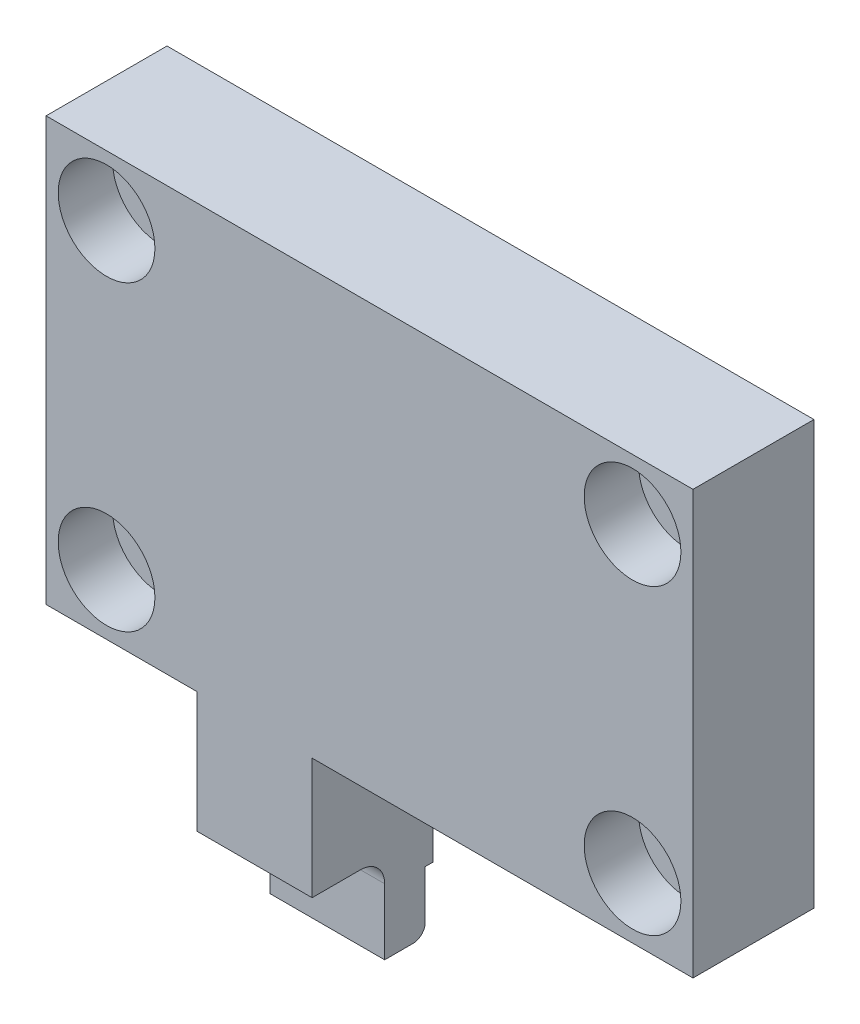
ISO-10303-21;
HEADER;
FILE_DESCRIPTION(('STEP AP214'),'2;1');
FILE_NAME('part.step','',(''),(''),'','','');
FILE_SCHEMA(('AUTOMOTIVE_DESIGN { 1 0 10303 214 1 1 1 1 }'));
ENDSEC;
DATA;
#1=APPLICATION_CONTEXT('core data for automotive mechanical design processes');
#2=APPLICATION_PROTOCOL_DEFINITION('international standard','automotive_design',2000,#1);
#3=PRODUCT_CONTEXT('',#1,'mechanical');
#4=PRODUCT('Part','Part','',(#3));
#5=PRODUCT_RELATED_PRODUCT_CATEGORY('part','',(#4));
#6=PRODUCT_DEFINITION_FORMATION('','',#4);
#7=PRODUCT_DEFINITION_CONTEXT('part definition',#1,'design');
#8=PRODUCT_DEFINITION('design','',#6,#7);
#9=PRODUCT_DEFINITION_SHAPE('','',#8);
#10=(LENGTH_UNIT() NAMED_UNIT(*) SI_UNIT(.MILLI.,.METRE.));
#11=(NAMED_UNIT(*) PLANE_ANGLE_UNIT() SI_UNIT($,.RADIAN.));
#12=(NAMED_UNIT(*) SI_UNIT($,.STERADIAN.) SOLID_ANGLE_UNIT());
#13=UNCERTAINTY_MEASURE_WITH_UNIT(LENGTH_MEASURE(1.E-05),#10,'distance_accuracy_value','');
#14=(GEOMETRIC_REPRESENTATION_CONTEXT(3) GLOBAL_UNCERTAINTY_ASSIGNED_CONTEXT((#13)) GLOBAL_UNIT_ASSIGNED_CONTEXT((#10,
#11,#12)) REPRESENTATION_CONTEXT('',''));
#15=CARTESIAN_POINT('',(0.,0.,0.));
#16=DIRECTION('',(0.,0.,1.));
#17=DIRECTION('',(1.,0.,0.));
#18=AXIS2_PLACEMENT_3D('',#15,#16,#17);
#19=CARTESIAN_POINT('',(12.5,17.4499995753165,10.));
#20=DIRECTION('',(0.,0.,1.));
#21=DIRECTION('',(1.,0.,0.));
#22=AXIS2_PLACEMENT_3D('',#19,#20,#21);
#23=PLANE('',#22);
#24=CARTESIAN_POINT('',(5.00000000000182,47.4499995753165,10.));
#25=DIRECTION('',(0.,0.,1.));
#26=DIRECTION('',(1.,0.,0.));
#27=AXIS2_PLACEMENT_3D('',#24,#25,#26);
#28=CIRCLE('',#27,4.);
#29=CARTESIAN_POINT('',(9.00000000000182,47.4499995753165,10.));
#30=VERTEX_POINT('',#29);
#31=EDGE_CURVE('E218',#30,#30,#28,.T.);
#32=ORIENTED_EDGE('',*,*,#31,.F.);
#33=EDGE_LOOP('',(#32));
#34=FACE_BOUND('',#33,.T.);
#35=CARTESIAN_POINT('',(48.5000000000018,47.4499995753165,10.));
#36=DIRECTION('',(0.,0.,1.));
#37=DIRECTION('',(1.,0.,0.));
#38=AXIS2_PLACEMENT_3D('',#35,#36,#37);
#39=CIRCLE('',#38,4.);
#40=CARTESIAN_POINT('',(52.5000000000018,47.4499995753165,10.));
#41=VERTEX_POINT('',#40);
#42=EDGE_CURVE('E223',#41,#41,#39,.T.);
#43=ORIENTED_EDGE('',*,*,#42,.F.);
#44=EDGE_LOOP('',(#43));
#45=FACE_BOUND('',#44,.T.);
#46=CARTESIAN_POINT('',(48.5000000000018,22.4499995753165,10.));
#47=DIRECTION('',(0.,0.,1.));
#48=DIRECTION('',(1.,0.,0.));
#49=AXIS2_PLACEMENT_3D('',#46,#47,#48);
#50=CIRCLE('',#49,4.);
#51=CARTESIAN_POINT('',(52.5000000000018,22.4499995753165,10.));
#52=VERTEX_POINT('',#51);
#53=EDGE_CURVE('E228',#52,#52,#50,.T.);
#54=ORIENTED_EDGE('',*,*,#53,.F.);
#55=EDGE_LOOP('',(#54));
#56=FACE_BOUND('',#55,.T.);
#57=CARTESIAN_POINT('',(5.00000000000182,22.4499995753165,10.));
#58=DIRECTION('',(0.,0.,1.));
#59=DIRECTION('',(1.,0.,0.));
#60=AXIS2_PLACEMENT_3D('',#57,#58,#59);
#61=CIRCLE('',#60,4.);
#62=CARTESIAN_POINT('',(9.00000000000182,22.4499995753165,10.));
#63=VERTEX_POINT('',#62);
#64=EDGE_CURVE('E276',#63,#63,#61,.T.);
#65=ORIENTED_EDGE('',*,*,#64,.F.);
#66=EDGE_LOOP('',(#65));
#67=FACE_BOUND('',#66,.T.);
#68=DIRECTION('',(0.,-1.,0.));
#69=VECTOR('',#68,1.);
#70=CARTESIAN_POINT('',(12.5,0.,10.));
#71=LINE('',#70,#69);
#72=CARTESIAN_POINT('',(12.5,17.4499995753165,10.));
#73=VERTEX_POINT('',#72);
#74=CARTESIAN_POINT('',(12.5,7.44999957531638,10.));
#75=VERTEX_POINT('',#74);
#76=EDGE_CURVE('E147',#73,#75,#71,.T.);
#77=ORIENTED_EDGE('',*,*,#76,.T.);
#78=DIRECTION('',(1.,0.,0.));
#79=VECTOR('',#78,1.);
#80=CARTESIAN_POINT('',(1.81799020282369E-12,7.44999957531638,10.));
#81=LINE('',#80,#79);
#82=CARTESIAN_POINT('',(22.,7.44999957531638,10.));
#83=VERTEX_POINT('',#82);
#84=EDGE_CURVE('E131',#75,#83,#81,.T.);
#85=ORIENTED_EDGE('',*,*,#84,.T.);
#86=DIRECTION('',(0.,1.,0.));
#87=VECTOR('',#86,1.);
#88=CARTESIAN_POINT('',(22.,0.,10.));
#89=LINE('',#88,#87);
#90=CARTESIAN_POINT('',(22.,17.4499995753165,10.));
#91=VERTEX_POINT('',#90);
#92=EDGE_CURVE('E156',#83,#91,#89,.T.);
#93=ORIENTED_EDGE('',*,*,#92,.T.);
#94=DIRECTION('',(1.,0.,0.));
#95=VECTOR('',#94,1.);
#96=CARTESIAN_POINT('',(22.,17.4499995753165,10.));
#97=LINE('',#96,#95);
#98=CARTESIAN_POINT('',(53.5000000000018,17.4499995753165,10.));
#99=VERTEX_POINT('',#98);
#100=EDGE_CURVE('E158',#91,#99,#97,.T.);
#101=ORIENTED_EDGE('',*,*,#100,.T.);
#102=DIRECTION('',(0.,1.,0.));
#103=VECTOR('',#102,1.);
#104=CARTESIAN_POINT('',(53.5000000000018,17.4499995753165,10.));
#105=LINE('',#104,#103);
#106=CARTESIAN_POINT('',(53.5000000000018,52.4499995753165,10.));
#107=VERTEX_POINT('',#106);
#108=EDGE_CURVE('E165',#99,#107,#105,.T.);
#109=ORIENTED_EDGE('',*,*,#108,.T.);
#110=DIRECTION('',(-1.,0.,0.));
#111=VECTOR('',#110,1.);
#112=CARTESIAN_POINT('',(1.81898940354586E-12,52.4499995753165,10.));
#113=LINE('',#112,#111);
#114=CARTESIAN_POINT('',(1.81898940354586E-12,52.4499995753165,10.));
#115=VERTEX_POINT('',#114);
#116=EDGE_CURVE('E167',#107,#115,#113,.T.);
#117=ORIENTED_EDGE('',*,*,#116,.T.);
#118=DIRECTION('',(0.,-1.,0.));
#119=VECTOR('',#118,1.);
#120=CARTESIAN_POINT('',(1.81898940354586E-12,17.4499995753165,10.));
#121=LINE('',#120,#119);
#122=CARTESIAN_POINT('',(1.81898940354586E-12,17.4499995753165,10.));
#123=VERTEX_POINT('',#122);
#124=EDGE_CURVE('E169',#115,#123,#121,.T.);
#125=ORIENTED_EDGE('',*,*,#124,.T.);
#126=DIRECTION('',(1.,0.,0.));
#127=VECTOR('',#126,1.);
#128=CARTESIAN_POINT('',(1.81898940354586E-12,17.4499995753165,10.));
#129=LINE('',#128,#127);
#130=EDGE_CURVE('E154',#123,#73,#129,.T.);
#131=ORIENTED_EDGE('',*,*,#130,.T.);
#132=EDGE_LOOP('',(#77,#85,#93,#101,#109,#117,#125,#131));
#133=FACE_BOUND('',#132,.T.);
#134=ADVANCED_FACE('F33',(#34,#45,#56,#67,#133),#23,.T.);
#135=CARTESIAN_POINT('',(12.5,17.4499995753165,0.));
#136=DIRECTION('',(0.,0.,1.));
#137=DIRECTION('',(1.,0.,0.));
#138=AXIS2_PLACEMENT_3D('',#135,#136,#137);
#139=PLANE('',#138);
#140=CARTESIAN_POINT('',(5.00000000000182,22.4499995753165,0.));
#141=DIRECTION('',(0.,0.,1.));
#142=DIRECTION('',(1.,0.,0.));
#143=AXIS2_PLACEMENT_3D('',#140,#141,#142);
#144=CIRCLE('',#143,2.25);
#145=CARTESIAN_POINT('',(7.25000000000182,22.4499995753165,0.));
#146=VERTEX_POINT('',#145);
#147=EDGE_CURVE('E213',#146,#146,#144,.T.);
#148=ORIENTED_EDGE('',*,*,#147,.T.);
#149=EDGE_LOOP('',(#148));
#150=FACE_BOUND('',#149,.T.);
#151=CARTESIAN_POINT('',(48.5000000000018,47.4499995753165,0.));
#152=DIRECTION('',(0.,0.,1.));
#153=DIRECTION('',(1.,0.,0.));
#154=AXIS2_PLACEMENT_3D('',#151,#152,#153);
#155=CIRCLE('',#154,2.25);
#156=CARTESIAN_POINT('',(50.7500000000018,47.4499995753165,0.));
#157=VERTEX_POINT('',#156);
#158=EDGE_CURVE('E298',#157,#157,#155,.T.);
#159=ORIENTED_EDGE('',*,*,#158,.T.);
#160=EDGE_LOOP('',(#159));
#161=FACE_BOUND('',#160,.T.);
#162=CARTESIAN_POINT('',(5.00000000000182,47.4499995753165,0.));
#163=DIRECTION('',(0.,0.,1.));
#164=DIRECTION('',(1.,0.,0.));
#165=AXIS2_PLACEMENT_3D('',#162,#163,#164);
#166=CIRCLE('',#165,2.25);
#167=CARTESIAN_POINT('',(7.25000000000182,47.4499995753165,0.));
#168=VERTEX_POINT('',#167);
#169=EDGE_CURVE('E176',#168,#168,#166,.T.);
#170=ORIENTED_EDGE('',*,*,#169,.T.);
#171=EDGE_LOOP('',(#170));
#172=FACE_BOUND('',#171,.T.);
#173=CARTESIAN_POINT('',(48.5000000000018,22.4499995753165,0.));
#174=DIRECTION('',(0.,0.,1.));
#175=DIRECTION('',(1.,0.,0.));
#176=AXIS2_PLACEMENT_3D('',#173,#174,#175);
#177=CIRCLE('',#176,2.25);
#178=CARTESIAN_POINT('',(50.7500000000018,22.4499995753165,0.));
#179=VERTEX_POINT('',#178);
#180=EDGE_CURVE('E295',#179,#179,#177,.T.);
#181=ORIENTED_EDGE('',*,*,#180,.T.);
#182=EDGE_LOOP('',(#181));
#183=FACE_BOUND('',#182,.T.);
#184=DIRECTION('',(1.,0.,0.));
#185=VECTOR('',#184,1.);
#186=CARTESIAN_POINT('',(1.81799020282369E-12,4.99999999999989,0.));
#187=LINE('',#186,#185);
#188=CARTESIAN_POINT('',(12.5,4.99999999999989,0.));
#189=VERTEX_POINT('',#188);
#190=CARTESIAN_POINT('',(22.,4.99999999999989,0.));
#191=VERTEX_POINT('',#190);
#192=EDGE_CURVE('E140',#189,#191,#187,.T.);
#193=ORIENTED_EDGE('',*,*,#192,.F.);
#194=DIRECTION('',(0.,-1.,0.));
#195=VECTOR('',#194,1.);
#196=CARTESIAN_POINT('',(12.5,0.,0.));
#197=LINE('',#196,#195);
#198=CARTESIAN_POINT('',(12.5,17.4499995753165,0.));
#199=VERTEX_POINT('',#198);
#200=EDGE_CURVE('E175',#199,#189,#197,.T.);
#201=ORIENTED_EDGE('',*,*,#200,.F.);
#202=DIRECTION('',(1.,0.,0.));
#203=VECTOR('',#202,1.);
#204=CARTESIAN_POINT('',(1.81898940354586E-12,17.4499995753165,0.));
#205=LINE('',#204,#203);
#206=CARTESIAN_POINT('',(1.81898940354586E-12,17.4499995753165,0.));
#207=VERTEX_POINT('',#206);
#208=EDGE_CURVE('E172',#207,#199,#205,.T.);
#209=ORIENTED_EDGE('',*,*,#208,.F.);
#210=DIRECTION('',(0.,-1.,0.));
#211=VECTOR('',#210,1.);
#212=CARTESIAN_POINT('',(1.81898940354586E-12,17.4499995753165,0.));
#213=LINE('',#212,#211);
#214=CARTESIAN_POINT('',(1.81898940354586E-12,52.4499995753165,0.));
#215=VERTEX_POINT('',#214);
#216=EDGE_CURVE('E160',#215,#207,#213,.T.);
#217=ORIENTED_EDGE('',*,*,#216,.F.);
#218=DIRECTION('',(-1.,0.,0.));
#219=VECTOR('',#218,1.);
#220=CARTESIAN_POINT('',(1.81898940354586E-12,52.4499995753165,0.));
#221=LINE('',#220,#219);
#222=CARTESIAN_POINT('',(53.5000000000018,52.4499995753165,0.));
#223=VERTEX_POINT('',#222);
#224=EDGE_CURVE('E185',#223,#215,#221,.T.);
#225=ORIENTED_EDGE('',*,*,#224,.F.);
#226=DIRECTION('',(0.,1.,0.));
#227=VECTOR('',#226,1.);
#228=CARTESIAN_POINT('',(53.5000000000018,17.4499995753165,0.));
#229=LINE('',#228,#227);
#230=CARTESIAN_POINT('',(53.5000000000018,17.4499995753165,0.));
#231=VERTEX_POINT('',#230);
#232=EDGE_CURVE('E183',#231,#223,#229,.T.);
#233=ORIENTED_EDGE('',*,*,#232,.F.);
#234=DIRECTION('',(1.,0.,0.));
#235=VECTOR('',#234,1.);
#236=CARTESIAN_POINT('',(22.,17.4499995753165,0.));
#237=LINE('',#236,#235);
#238=CARTESIAN_POINT('',(22.,17.4499995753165,0.));
#239=VERTEX_POINT('',#238);
#240=EDGE_CURVE('E181',#239,#231,#237,.T.);
#241=ORIENTED_EDGE('',*,*,#240,.F.);
#242=DIRECTION('',(0.,1.,0.));
#243=VECTOR('',#242,1.);
#244=CARTESIAN_POINT('',(22.,0.,0.));
#245=LINE('',#244,#243);
#246=EDGE_CURVE('E179',#191,#239,#245,.T.);
#247=ORIENTED_EDGE('',*,*,#246,.F.);
#248=EDGE_LOOP('',(#193,#201,#209,#217,#225,#233,#241,#247));
#249=FACE_BOUND('',#248,.T.);
#250=ADVANCED_FACE('F303',(#150,#161,#172,#183,#249),#139,.F.);
#251=CARTESIAN_POINT('',(12.5,0.,10.));
#252=DIRECTION('',(1.,0.,0.));
#253=DIRECTION('',(0.,0.,-1.));
#254=AXIS2_PLACEMENT_3D('',#251,#252,#253);
#255=PLANE('',#254);
#256=DIRECTION('',(0.,0.,-1.));
#257=VECTOR('',#256,1.);
#258=CARTESIAN_POINT('',(12.5,4.99999999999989,10.));
#259=LINE('',#258,#257);
#260=CARTESIAN_POINT('',(12.5,4.99999999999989,0.650000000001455));
#261=VERTEX_POINT('',#260);
#262=EDGE_CURVE('E274',#261,#189,#259,.T.);
#263=ORIENTED_EDGE('',*,*,#262,.F.);
#264=DIRECTION('',(0.,1.,0.));
#265=VECTOR('',#264,1.);
#266=CARTESIAN_POINT('',(12.5,0.,0.650000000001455));
#267=LINE('',#266,#265);
#268=CARTESIAN_POINT('',(12.5,0.999999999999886,0.650000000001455));
#269=VERTEX_POINT('',#268);
#270=EDGE_CURVE('E272',#269,#261,#267,.T.);
#271=ORIENTED_EDGE('',*,*,#270,.F.);
#272=CARTESIAN_POINT('',(12.5,0.999999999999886,1.65000000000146));
#273=DIRECTION('',(1.,0.,0.));
#274=DIRECTION('',(0.,0.,-1.));
#275=AXIS2_PLACEMENT_3D('',#272,#273,#274);
#276=CIRCLE('',#275,1.);
#277=CARTESIAN_POINT('',(12.5,-1.13686837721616E-13,1.65000000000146));
#278=VERTEX_POINT('',#277);
#279=EDGE_CURVE('E270',#278,#269,#276,.T.);
#280=ORIENTED_EDGE('',*,*,#279,.F.);
#281=DIRECTION('',(0.,0.,-1.));
#282=VECTOR('',#281,1.);
#283=CARTESIAN_POINT('',(12.5,0.,10.));
#284=LINE('',#283,#282);
#285=CARTESIAN_POINT('',(12.5,-1.13686837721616E-13,4.));
#286=VERTEX_POINT('',#285);
#287=EDGE_CURVE('E205',#286,#278,#284,.T.);
#288=ORIENTED_EDGE('',*,*,#287,.F.);
#289=DIRECTION('',(0.,-1.,0.));
#290=VECTOR('',#289,1.);
#291=CARTESIAN_POINT('',(12.5,0.,4.));
#292=LINE('',#291,#290);
#293=CARTESIAN_POINT('',(12.5,5.44999957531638,4.));
#294=VERTEX_POINT('',#293);
#295=EDGE_CURVE('E268',#294,#286,#292,.T.);
#296=ORIENTED_EDGE('',*,*,#295,.F.);
#297=CARTESIAN_POINT('',(12.5,5.44999957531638,6.));
#298=DIRECTION('',(1.,0.,0.));
#299=DIRECTION('',(0.,0.,-1.));
#300=AXIS2_PLACEMENT_3D('',#297,#298,#299);
#301=CIRCLE('',#300,2.);
#302=CARTESIAN_POINT('',(12.5,7.44999957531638,6.));
#303=VERTEX_POINT('',#302);
#304=EDGE_CURVE('E150',#303,#294,#301,.F.);
#305=ORIENTED_EDGE('',*,*,#304,.F.);
#306=DIRECTION('',(0.,0.,-1.));
#307=VECTOR('',#306,1.);
#308=CARTESIAN_POINT('',(12.5,7.44999957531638,10.));
#309=LINE('',#308,#307);
#310=EDGE_CURVE('E134',#75,#303,#309,.T.);
#311=ORIENTED_EDGE('',*,*,#310,.F.);
#312=ORIENTED_EDGE('',*,*,#76,.F.);
#313=DIRECTION('',(0.,0.,-1.));
#314=VECTOR('',#313,1.);
#315=CARTESIAN_POINT('',(12.5,17.4499995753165,10.));
#316=LINE('',#315,#314);
#317=EDGE_CURVE('E208',#73,#199,#316,.T.);
#318=ORIENTED_EDGE('',*,*,#317,.T.);
#319=ORIENTED_EDGE('',*,*,#200,.T.);
#320=EDGE_LOOP('',(#263,#271,#280,#288,#296,#305,#311,#312,#318,#319));
#321=FACE_BOUND('',#320,.T.);
#322=ADVANCED_FACE('F145',(#321),#255,.F.);
#323=CARTESIAN_POINT('',(12.5,0.,10.));
#324=DIRECTION('',(0.,1.,0.));
#325=DIRECTION('',(0.,0.,1.));
#326=AXIS2_PLACEMENT_3D('',#323,#324,#325);
#327=PLANE('',#326);
#328=ORIENTED_EDGE('',*,*,#287,.T.);
#329=DIRECTION('',(1.,0.,0.));
#330=VECTOR('',#329,1.);
#331=CARTESIAN_POINT('',(1.81799020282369E-12,-1.13686837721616E-13,1.65000000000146));
#332=LINE('',#331,#330);
#333=CARTESIAN_POINT('',(22.,-1.13686837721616E-13,1.65000000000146));
#334=VERTEX_POINT('',#333);
#335=EDGE_CURVE('E250',#278,#334,#332,.T.);
#336=ORIENTED_EDGE('',*,*,#335,.T.);
#337=DIRECTION('',(0.,0.,-1.));
#338=VECTOR('',#337,1.);
#339=CARTESIAN_POINT('',(22.,0.,10.));
#340=LINE('',#339,#338);
#341=CARTESIAN_POINT('',(22.,-1.13686837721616E-13,4.));
#342=VERTEX_POINT('',#341);
#343=EDGE_CURVE('E202',#342,#334,#340,.T.);
#344=ORIENTED_EDGE('',*,*,#343,.F.);
#345=DIRECTION('',(1.,0.,0.));
#346=VECTOR('',#345,1.);
#347=CARTESIAN_POINT('',(1.81799020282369E-12,-1.13686837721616E-13,4.));
#348=LINE('',#347,#346);
#349=EDGE_CURVE('E256',#286,#342,#348,.T.);
#350=ORIENTED_EDGE('',*,*,#349,.F.);
#351=EDGE_LOOP('',(#328,#336,#344,#350));
#352=FACE_BOUND('',#351,.T.);
#353=ADVANCED_FACE('F253',(#352),#327,.F.);
#354=CARTESIAN_POINT('',(22.,0.,10.));
#355=DIRECTION('',(-1.,0.,0.));
#356=DIRECTION('',(0.,0.,1.));
#357=AXIS2_PLACEMENT_3D('',#354,#355,#356);
#358=PLANE('',#357);
#359=DIRECTION('',(0.,0.,1.));
#360=VECTOR('',#359,1.);
#361=CARTESIAN_POINT('',(22.,4.99999999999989,10.));
#362=LINE('',#361,#360);
#363=CARTESIAN_POINT('',(22.,4.99999999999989,0.650000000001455));
#364=VERTEX_POINT('',#363);
#365=EDGE_CURVE('E12',#191,#364,#362,.T.);
#366=ORIENTED_EDGE('',*,*,#365,.F.);
#367=ORIENTED_EDGE('',*,*,#246,.T.);
#368=DIRECTION('',(0.,0.,-1.));
#369=VECTOR('',#368,1.);
#370=CARTESIAN_POINT('',(22.,17.4499995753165,10.));
#371=LINE('',#370,#369);
#372=EDGE_CURVE('E199',#91,#239,#371,.T.);
#373=ORIENTED_EDGE('',*,*,#372,.F.);
#374=ORIENTED_EDGE('',*,*,#92,.F.);
#375=DIRECTION('',(0.,0.,1.));
#376=VECTOR('',#375,1.);
#377=CARTESIAN_POINT('',(22.,7.44999957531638,10.));
#378=LINE('',#377,#376);
#379=CARTESIAN_POINT('',(22.,7.44999957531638,6.));
#380=VERTEX_POINT('',#379);
#381=EDGE_CURVE('E136',#380,#83,#378,.T.);
#382=ORIENTED_EDGE('',*,*,#381,.F.);
#383=CARTESIAN_POINT('',(22.,5.44999957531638,6.));
#384=DIRECTION('',(-1.,0.,0.));
#385=DIRECTION('',(0.,0.,1.));
#386=AXIS2_PLACEMENT_3D('',#383,#384,#385);
#387=CIRCLE('',#386,2.);
#388=CARTESIAN_POINT('',(22.,5.44999957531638,4.));
#389=VERTEX_POINT('',#388);
#390=EDGE_CURVE('E231',#389,#380,#387,.F.);
#391=ORIENTED_EDGE('',*,*,#390,.F.);
#392=DIRECTION('',(0.,1.,0.));
#393=VECTOR('',#392,1.);
#394=CARTESIAN_POINT('',(22.,0.,4.));
#395=LINE('',#394,#393);
#396=EDGE_CURVE('E233',#342,#389,#395,.T.);
#397=ORIENTED_EDGE('',*,*,#396,.F.);
#398=ORIENTED_EDGE('',*,*,#343,.T.);
#399=CARTESIAN_POINT('',(22.,0.999999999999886,1.65000000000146));
#400=DIRECTION('',(-1.,0.,0.));
#401=DIRECTION('',(0.,0.,1.));
#402=AXIS2_PLACEMENT_3D('',#399,#400,#401);
#403=CIRCLE('',#402,1.);
#404=CARTESIAN_POINT('',(22.,0.999999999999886,0.650000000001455));
#405=VERTEX_POINT('',#404);
#406=EDGE_CURVE('E235',#405,#334,#403,.T.);
#407=ORIENTED_EDGE('',*,*,#406,.F.);
#408=DIRECTION('',(0.,-1.,0.));
#409=VECTOR('',#408,1.);
#410=CARTESIAN_POINT('',(22.,0.,0.650000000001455));
#411=LINE('',#410,#409);
#412=EDGE_CURVE('E41',#364,#405,#411,.T.);
#413=ORIENTED_EDGE('',*,*,#412,.F.);
#414=EDGE_LOOP('',(#366,#367,#373,#374,#382,#391,#397,#398,#407,#413));
#415=FACE_BOUND('',#414,.T.);
#416=ADVANCED_FACE('F245',(#415),#358,.F.);
#417=CARTESIAN_POINT('',(5.00000000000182,22.4499995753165,10.));
#418=DIRECTION('',(0.,0.,-1.));
#419=DIRECTION('',(-1.,0.,0.));
#420=AXIS2_PLACEMENT_3D('',#417,#418,#419);
#421=CYLINDRICAL_SURFACE('',#420,2.25);
#422=ORIENTED_EDGE('',*,*,#147,.F.);
#423=EDGE_LOOP('',(#422));
#424=FACE_BOUND('',#423,.T.);
#425=CARTESIAN_POINT('',(5.00000000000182,22.4499995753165,5.5));
#426=DIRECTION('',(0.,0.,1.));
#427=DIRECTION('',(1.,0.,0.));
#428=AXIS2_PLACEMENT_3D('',#425,#426,#427);
#429=CIRCLE('',#428,2.25);
#430=CARTESIAN_POINT('',(7.25000000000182,22.4499995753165,5.5));
#431=VERTEX_POINT('',#430);
#432=EDGE_CURVE('E225',#431,#431,#429,.T.);
#433=ORIENTED_EDGE('',*,*,#432,.T.);
#434=EDGE_LOOP('',(#433));
#435=FACE_BOUND('',#434,.T.);
#436=ADVANCED_FACE('F364',(#424,#435),#421,.F.);
#437=CARTESIAN_POINT('',(48.5000000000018,22.4499995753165,10.));
#438=DIRECTION('',(0.,0.,-1.));
#439=DIRECTION('',(-1.,0.,0.));
#440=AXIS2_PLACEMENT_3D('',#437,#438,#439);
#441=CYLINDRICAL_SURFACE('',#440,2.25);
#442=ORIENTED_EDGE('',*,*,#180,.F.);
#443=EDGE_LOOP('',(#442));
#444=FACE_BOUND('',#443,.T.);
#445=CARTESIAN_POINT('',(48.5000000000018,22.4499995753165,5.5));
#446=DIRECTION('',(0.,0.,1.));
#447=DIRECTION('',(1.,0.,0.));
#448=AXIS2_PLACEMENT_3D('',#445,#446,#447);
#449=CIRCLE('',#448,2.25);
#450=CARTESIAN_POINT('',(50.7500000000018,22.4499995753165,5.5));
#451=VERTEX_POINT('',#450);
#452=EDGE_CURVE('E220',#451,#451,#449,.T.);
#453=ORIENTED_EDGE('',*,*,#452,.T.);
#454=EDGE_LOOP('',(#453));
#455=FACE_BOUND('',#454,.T.);
#456=ADVANCED_FACE('F367',(#444,#455),#441,.F.);
#457=CARTESIAN_POINT('',(48.5000000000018,47.4499995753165,10.));
#458=DIRECTION('',(0.,0.,-1.));
#459=DIRECTION('',(-1.,0.,0.));
#460=AXIS2_PLACEMENT_3D('',#457,#458,#459);
#461=CYLINDRICAL_SURFACE('',#460,2.25);
#462=ORIENTED_EDGE('',*,*,#158,.F.);
#463=EDGE_LOOP('',(#462));
#464=FACE_BOUND('',#463,.T.);
#465=CARTESIAN_POINT('',(48.5000000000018,47.4499995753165,5.5));
#466=DIRECTION('',(0.,0.,1.));
#467=DIRECTION('',(1.,0.,0.));
#468=AXIS2_PLACEMENT_3D('',#465,#466,#467);
#469=CIRCLE('',#468,2.25);
#470=CARTESIAN_POINT('',(50.7500000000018,47.4499995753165,5.5));
#471=VERTEX_POINT('',#470);
#472=EDGE_CURVE('E215',#471,#471,#469,.T.);
#473=ORIENTED_EDGE('',*,*,#472,.T.);
#474=EDGE_LOOP('',(#473));
#475=FACE_BOUND('',#474,.T.);
#476=ADVANCED_FACE('F309',(#464,#475),#461,.F.);
#477=CARTESIAN_POINT('',(5.00000000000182,47.4499995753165,10.));
#478=DIRECTION('',(0.,0.,-1.));
#479=DIRECTION('',(-1.,0.,0.));
#480=AXIS2_PLACEMENT_3D('',#477,#478,#479);
#481=CYLINDRICAL_SURFACE('',#480,2.25);
#482=ORIENTED_EDGE('',*,*,#169,.F.);
#483=EDGE_LOOP('',(#482));
#484=FACE_BOUND('',#483,.T.);
#485=CARTESIAN_POINT('',(5.00000000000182,47.4499995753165,5.5));
#486=DIRECTION('',(0.,0.,1.));
#487=DIRECTION('',(1.,0.,0.));
#488=AXIS2_PLACEMENT_3D('',#485,#486,#487);
#489=CIRCLE('',#488,2.25);
#490=CARTESIAN_POINT('',(7.25000000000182,47.4499995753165,5.5));
#491=VERTEX_POINT('',#490);
#492=EDGE_CURVE('E210',#491,#491,#489,.T.);
#493=ORIENTED_EDGE('',*,*,#492,.T.);
#494=EDGE_LOOP('',(#493));
#495=FACE_BOUND('',#494,.T.);
#496=ADVANCED_FACE('F306',(#484,#495),#481,.F.);
#497=CARTESIAN_POINT('',(1.81898940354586E-12,17.4499995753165,10.));
#498=DIRECTION('',(0.,1.,0.));
#499=DIRECTION('',(0.,0.,1.));
#500=AXIS2_PLACEMENT_3D('',#497,#498,#499);
#501=PLANE('',#500);
#502=ORIENTED_EDGE('',*,*,#208,.T.);
#503=ORIENTED_EDGE('',*,*,#317,.F.);
#504=ORIENTED_EDGE('',*,*,#130,.F.);
#505=DIRECTION('',(0.,0.,-1.));
#506=VECTOR('',#505,1.);
#507=CARTESIAN_POINT('',(1.81898940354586E-12,17.4499995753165,10.));
#508=LINE('',#507,#506);
#509=EDGE_CURVE('E171',#123,#207,#508,.T.);
#510=ORIENTED_EDGE('',*,*,#509,.T.);
#511=EDGE_LOOP('',(#502,#503,#504,#510));
#512=FACE_BOUND('',#511,.T.);
#513=ADVANCED_FACE('F35',(#512),#501,.F.);
#514=CARTESIAN_POINT('',(22.,17.4499995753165,10.));
#515=DIRECTION('',(0.,1.,0.));
#516=DIRECTION('',(0.,0.,1.));
#517=AXIS2_PLACEMENT_3D('',#514,#515,#516);
#518=PLANE('',#517);
#519=ORIENTED_EDGE('',*,*,#240,.T.);
#520=DIRECTION('',(0.,0.,-1.));
#521=VECTOR('',#520,1.);
#522=CARTESIAN_POINT('',(53.5000000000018,17.4499995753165,10.));
#523=LINE('',#522,#521);
#524=EDGE_CURVE('E196',#99,#231,#523,.T.);
#525=ORIENTED_EDGE('',*,*,#524,.F.);
#526=ORIENTED_EDGE('',*,*,#100,.F.);
#527=ORIENTED_EDGE('',*,*,#372,.T.);
#528=EDGE_LOOP('',(#519,#525,#526,#527));
#529=FACE_BOUND('',#528,.T.);
#530=ADVANCED_FACE('F388',(#529),#518,.F.);
#531=CARTESIAN_POINT('',(53.5000000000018,17.4499995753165,10.));
#532=DIRECTION('',(-1.,0.,0.));
#533=DIRECTION('',(0.,0.,1.));
#534=AXIS2_PLACEMENT_3D('',#531,#532,#533);
#535=PLANE('',#534);
#536=ORIENTED_EDGE('',*,*,#232,.T.);
#537=DIRECTION('',(0.,0.,-1.));
#538=VECTOR('',#537,1.);
#539=CARTESIAN_POINT('',(53.5000000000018,52.4499995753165,10.));
#540=LINE('',#539,#538);
#541=EDGE_CURVE('E193',#107,#223,#540,.T.);
#542=ORIENTED_EDGE('',*,*,#541,.F.);
#543=ORIENTED_EDGE('',*,*,#108,.F.);
#544=ORIENTED_EDGE('',*,*,#524,.T.);
#545=EDGE_LOOP('',(#536,#542,#543,#544));
#546=FACE_BOUND('',#545,.T.);
#547=ADVANCED_FACE('F384',(#546),#535,.F.);
#548=CARTESIAN_POINT('',(1.81898940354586E-12,52.4499995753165,10.));
#549=DIRECTION('',(0.,-1.,0.));
#550=DIRECTION('',(0.,0.,-1.));
#551=AXIS2_PLACEMENT_3D('',#548,#549,#550);
#552=PLANE('',#551);
#553=ORIENTED_EDGE('',*,*,#224,.T.);
#554=DIRECTION('',(0.,0.,-1.));
#555=VECTOR('',#554,1.);
#556=CARTESIAN_POINT('',(1.81898940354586E-12,52.4499995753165,10.));
#557=LINE('',#556,#555);
#558=EDGE_CURVE('E190',#115,#215,#557,.T.);
#559=ORIENTED_EDGE('',*,*,#558,.F.);
#560=ORIENTED_EDGE('',*,*,#116,.F.);
#561=ORIENTED_EDGE('',*,*,#541,.T.);
#562=EDGE_LOOP('',(#553,#559,#560,#561));
#563=FACE_BOUND('',#562,.T.);
#564=ADVANCED_FACE('F380',(#563),#552,.F.);
#565=CARTESIAN_POINT('',(1.81898940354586E-12,17.4499995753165,10.));
#566=DIRECTION('',(1.,0.,0.));
#567=DIRECTION('',(0.,0.,-1.));
#568=AXIS2_PLACEMENT_3D('',#565,#566,#567);
#569=PLANE('',#568);
#570=ORIENTED_EDGE('',*,*,#216,.T.);
#571=ORIENTED_EDGE('',*,*,#509,.F.);
#572=ORIENTED_EDGE('',*,*,#124,.F.);
#573=ORIENTED_EDGE('',*,*,#558,.T.);
#574=EDGE_LOOP('',(#570,#571,#572,#573));
#575=FACE_BOUND('',#574,.T.);
#576=ADVANCED_FACE('F323',(#575),#569,.F.);
#577=CARTESIAN_POINT('',(5.00000000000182,47.4499995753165,5.5));
#578=DIRECTION('',(0.,0.,1.));
#579=DIRECTION('',(1.,0.,0.));
#580=AXIS2_PLACEMENT_3D('',#577,#578,#579);
#581=CYLINDRICAL_SURFACE('',#580,4.);
#582=CARTESIAN_POINT('',(5.00000000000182,47.4499995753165,5.5));
#583=DIRECTION('',(0.,0.,1.));
#584=DIRECTION('',(1.,0.,0.));
#585=AXIS2_PLACEMENT_3D('',#582,#583,#584);
#586=CIRCLE('',#585,4.);
#587=CARTESIAN_POINT('',(9.00000000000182,47.4499995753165,5.5));
#588=VERTEX_POINT('',#587);
#589=EDGE_CURVE('E214',#588,#588,#586,.T.);
#590=ORIENTED_EDGE('',*,*,#589,.F.);
#591=EDGE_LOOP('',(#590));
#592=FACE_BOUND('',#591,.T.);
#593=ORIENTED_EDGE('',*,*,#31,.T.);
#594=EDGE_LOOP('',(#593));
#595=FACE_BOUND('',#594,.T.);
#596=ADVANCED_FACE('F317',(#592,#595),#581,.F.);
#597=CARTESIAN_POINT('',(5.00000000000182,47.4499995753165,5.5));
#598=DIRECTION('',(0.,0.,1.));
#599=DIRECTION('',(1.,0.,0.));
#600=AXIS2_PLACEMENT_3D('',#597,#598,#599);
#601=PLANE('',#600);
#602=ORIENTED_EDGE('',*,*,#492,.F.);
#603=EDGE_LOOP('',(#602));
#604=FACE_BOUND('',#603,.T.);
#605=ORIENTED_EDGE('',*,*,#589,.T.);
#606=EDGE_LOOP('',(#605));
#607=FACE_BOUND('',#606,.T.);
#608=ADVANCED_FACE('F313',(#604,#607),#601,.T.);
#609=CARTESIAN_POINT('',(48.5000000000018,47.4499995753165,5.5));
#610=DIRECTION('',(0.,0.,1.));
#611=DIRECTION('',(1.,0.,0.));
#612=AXIS2_PLACEMENT_3D('',#609,#610,#611);
#613=CYLINDRICAL_SURFACE('',#612,4.);
#614=CARTESIAN_POINT('',(48.5000000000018,47.4499995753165,5.5));
#615=DIRECTION('',(0.,0.,1.));
#616=DIRECTION('',(1.,0.,0.));
#617=AXIS2_PLACEMENT_3D('',#614,#615,#616);
#618=CIRCLE('',#617,4.);
#619=CARTESIAN_POINT('',(52.5000000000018,47.4499995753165,5.5));
#620=VERTEX_POINT('',#619);
#621=EDGE_CURVE('E219',#620,#620,#618,.T.);
#622=ORIENTED_EDGE('',*,*,#621,.F.);
#623=EDGE_LOOP('',(#622));
#624=FACE_BOUND('',#623,.T.);
#625=ORIENTED_EDGE('',*,*,#42,.T.);
#626=EDGE_LOOP('',(#625));
#627=FACE_BOUND('',#626,.T.);
#628=ADVANCED_FACE('F316',(#624,#627),#613,.F.);
#629=CARTESIAN_POINT('',(48.5000000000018,47.4499995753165,5.5));
#630=DIRECTION('',(0.,0.,1.));
#631=DIRECTION('',(1.,0.,0.));
#632=AXIS2_PLACEMENT_3D('',#629,#630,#631);
#633=PLANE('',#632);
#634=ORIENTED_EDGE('',*,*,#472,.F.);
#635=EDGE_LOOP('',(#634));
#636=FACE_BOUND('',#635,.T.);
#637=ORIENTED_EDGE('',*,*,#621,.T.);
#638=EDGE_LOOP('',(#637));
#639=FACE_BOUND('',#638,.T.);
#640=ADVANCED_FACE('F356',(#636,#639),#633,.T.);
#641=CARTESIAN_POINT('',(48.5000000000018,22.4499995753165,5.5));
#642=DIRECTION('',(0.,0.,1.));
#643=DIRECTION('',(1.,0.,0.));
#644=AXIS2_PLACEMENT_3D('',#641,#642,#643);
#645=CYLINDRICAL_SURFACE('',#644,4.);
#646=CARTESIAN_POINT('',(48.5000000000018,22.4499995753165,5.5));
#647=DIRECTION('',(0.,0.,1.));
#648=DIRECTION('',(1.,0.,0.));
#649=AXIS2_PLACEMENT_3D('',#646,#647,#648);
#650=CIRCLE('',#649,4.);
#651=CARTESIAN_POINT('',(52.5000000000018,22.4499995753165,5.5));
#652=VERTEX_POINT('',#651);
#653=EDGE_CURVE('E224',#652,#652,#650,.T.);
#654=ORIENTED_EDGE('',*,*,#653,.F.);
#655=EDGE_LOOP('',(#654));
#656=FACE_BOUND('',#655,.T.);
#657=ORIENTED_EDGE('',*,*,#53,.T.);
#658=EDGE_LOOP('',(#657));
#659=FACE_BOUND('',#658,.T.);
#660=ADVANCED_FACE('F348',(#656,#659),#645,.F.);
#661=CARTESIAN_POINT('',(48.5000000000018,22.4499995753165,5.5));
#662=DIRECTION('',(0.,0.,1.));
#663=DIRECTION('',(1.,0.,0.));
#664=AXIS2_PLACEMENT_3D('',#661,#662,#663);
#665=PLANE('',#664);
#666=ORIENTED_EDGE('',*,*,#452,.F.);
#667=EDGE_LOOP('',(#666));
#668=FACE_BOUND('',#667,.T.);
#669=ORIENTED_EDGE('',*,*,#653,.T.);
#670=EDGE_LOOP('',(#669));
#671=FACE_BOUND('',#670,.T.);
#672=ADVANCED_FACE('F339',(#668,#671),#665,.T.);
#673=CARTESIAN_POINT('',(5.00000000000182,22.4499995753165,5.5));
#674=DIRECTION('',(0.,0.,1.));
#675=DIRECTION('',(1.,0.,0.));
#676=AXIS2_PLACEMENT_3D('',#673,#674,#675);
#677=CYLINDRICAL_SURFACE('',#676,4.);
#678=CARTESIAN_POINT('',(5.00000000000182,22.4499995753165,5.5));
#679=DIRECTION('',(0.,0.,1.));
#680=DIRECTION('',(1.,0.,0.));
#681=AXIS2_PLACEMENT_3D('',#678,#679,#680);
#682=CIRCLE('',#681,4.);
#683=CARTESIAN_POINT('',(9.00000000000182,22.4499995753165,5.5));
#684=VERTEX_POINT('',#683);
#685=EDGE_CURVE('E229',#684,#684,#682,.T.);
#686=ORIENTED_EDGE('',*,*,#685,.F.);
#687=EDGE_LOOP('',(#686));
#688=FACE_BOUND('',#687,.T.);
#689=ORIENTED_EDGE('',*,*,#64,.T.);
#690=EDGE_LOOP('',(#689));
#691=FACE_BOUND('',#690,.T.);
#692=ADVANCED_FACE('F336',(#688,#691),#677,.F.);
#693=CARTESIAN_POINT('',(5.00000000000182,22.4499995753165,5.5));
#694=DIRECTION('',(0.,0.,1.));
#695=DIRECTION('',(1.,0.,0.));
#696=AXIS2_PLACEMENT_3D('',#693,#694,#695);
#697=PLANE('',#696);
#698=ORIENTED_EDGE('',*,*,#432,.F.);
#699=EDGE_LOOP('',(#698));
#700=FACE_BOUND('',#699,.T.);
#701=ORIENTED_EDGE('',*,*,#685,.T.);
#702=EDGE_LOOP('',(#701));
#703=FACE_BOUND('',#702,.T.);
#704=ADVANCED_FACE('F338',(#700,#703),#697,.T.);
#705=CARTESIAN_POINT('',(1.81799020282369E-12,7.44999957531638,10.));
#706=DIRECTION('',(0.,-1.,0.));
#707=DIRECTION('',(0.,0.,-1.));
#708=AXIS2_PLACEMENT_3D('',#705,#706,#707);
#709=PLANE('',#708);
#710=ORIENTED_EDGE('',*,*,#310,.T.);
#711=DIRECTION('',(1.,0.,0.));
#712=VECTOR('',#711,1.);
#713=CARTESIAN_POINT('',(1.81799020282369E-12,7.44999957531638,6.));
#714=LINE('',#713,#712);
#715=EDGE_CURVE('E56',#303,#380,#714,.T.);
#716=ORIENTED_EDGE('',*,*,#715,.T.);
#717=ORIENTED_EDGE('',*,*,#381,.T.);
#718=ORIENTED_EDGE('',*,*,#84,.F.);
#719=EDGE_LOOP('',(#710,#716,#717,#718));
#720=FACE_BOUND('',#719,.T.);
#721=ADVANCED_FACE('F133',(#720),#709,.T.);
#722=CARTESIAN_POINT('',(1.81799020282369E-12,5.44999957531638,6.));
#723=DIRECTION('',(1.,0.,0.));
#724=DIRECTION('',(0.,0.,-1.));
#725=AXIS2_PLACEMENT_3D('',#722,#723,#724);
#726=CYLINDRICAL_SURFACE('',#725,2.);
#727=ORIENTED_EDGE('',*,*,#304,.T.);
#728=DIRECTION('',(1.,0.,0.));
#729=VECTOR('',#728,1.);
#730=CARTESIAN_POINT('',(1.81799020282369E-12,5.44999957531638,4.));
#731=LINE('',#730,#729);
#732=EDGE_CURVE('E259',#294,#389,#731,.T.);
#733=ORIENTED_EDGE('',*,*,#732,.T.);
#734=ORIENTED_EDGE('',*,*,#390,.T.);
#735=ORIENTED_EDGE('',*,*,#715,.F.);
#736=EDGE_LOOP('',(#727,#733,#734,#735));
#737=FACE_BOUND('',#736,.T.);
#738=ADVANCED_FACE('F507',(#737),#726,.F.);
#739=CARTESIAN_POINT('',(1.81799020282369E-12,-1.13686837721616E-13,4.));
#740=DIRECTION('',(0.,0.,1.));
#741=DIRECTION('',(1.,0.,0.));
#742=AXIS2_PLACEMENT_3D('',#739,#740,#741);
#743=PLANE('',#742);
#744=ORIENTED_EDGE('',*,*,#295,.T.);
#745=ORIENTED_EDGE('',*,*,#349,.T.);
#746=ORIENTED_EDGE('',*,*,#396,.T.);
#747=ORIENTED_EDGE('',*,*,#732,.F.);
#748=EDGE_LOOP('',(#744,#745,#746,#747));
#749=FACE_BOUND('',#748,.T.);
#750=ADVANCED_FACE('F515',(#749),#743,.T.);
#751=CARTESIAN_POINT('',(1.81799020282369E-12,4.99999999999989,0.650000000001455));
#752=DIRECTION('',(0.,-1.,0.));
#753=DIRECTION('',(0.,0.,-1.));
#754=AXIS2_PLACEMENT_3D('',#751,#752,#753);
#755=PLANE('',#754);
#756=ORIENTED_EDGE('',*,*,#262,.T.);
#757=ORIENTED_EDGE('',*,*,#192,.T.);
#758=ORIENTED_EDGE('',*,*,#365,.T.);
#759=DIRECTION('',(1.,0.,0.));
#760=VECTOR('',#759,1.);
#761=CARTESIAN_POINT('',(1.81799020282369E-12,4.99999999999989,0.650000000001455));
#762=LINE('',#761,#760);
#763=EDGE_CURVE('E151',#261,#364,#762,.T.);
#764=ORIENTED_EDGE('',*,*,#763,.F.);
#765=EDGE_LOOP('',(#756,#757,#758,#764));
#766=FACE_BOUND('',#765,.T.);
#767=ADVANCED_FACE('F524',(#766),#755,.T.);
#768=CARTESIAN_POINT('',(1.81799020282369E-12,0.999999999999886,0.650000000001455));
#769=DIRECTION('',(0.,0.,-1.));
#770=DIRECTION('',(-1.,0.,0.));
#771=AXIS2_PLACEMENT_3D('',#768,#769,#770);
#772=PLANE('',#771);
#773=ORIENTED_EDGE('',*,*,#270,.T.);
#774=ORIENTED_EDGE('',*,*,#763,.T.);
#775=ORIENTED_EDGE('',*,*,#412,.T.);
#776=DIRECTION('',(1.,0.,0.));
#777=VECTOR('',#776,1.);
#778=CARTESIAN_POINT('',(1.81799020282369E-12,0.999999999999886,0.650000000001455));
#779=LINE('',#778,#777);
#780=EDGE_CURVE('E48',#269,#405,#779,.T.);
#781=ORIENTED_EDGE('',*,*,#780,.F.);
#782=EDGE_LOOP('',(#773,#774,#775,#781));
#783=FACE_BOUND('',#782,.T.);
#784=ADVANCED_FACE('F240',(#783),#772,.T.);
#785=CARTESIAN_POINT('',(1.81799020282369E-12,0.999999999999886,1.65000000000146));
#786=DIRECTION('',(1.,0.,0.));
#787=DIRECTION('',(0.,0.,-1.));
#788=AXIS2_PLACEMENT_3D('',#785,#786,#787);
#789=CYLINDRICAL_SURFACE('',#788,1.);
#790=ORIENTED_EDGE('',*,*,#279,.T.);
#791=ORIENTED_EDGE('',*,*,#780,.T.);
#792=ORIENTED_EDGE('',*,*,#406,.T.);
#793=ORIENTED_EDGE('',*,*,#335,.F.);
#794=EDGE_LOOP('',(#790,#791,#792,#793));
#795=FACE_BOUND('',#794,.T.);
#796=ADVANCED_FACE('F249',(#795),#789,.T.);
#797=CLOSED_SHELL('',(#134,#250,#322,#353,#416,#436,#456,#476,#496,#513,#530,#547,#564,#576,
#596,#608,#628,#640,#660,#672,#692,#704,#721,#738,#750,#767,#784,#796));
#798=MANIFOLD_SOLID_BREP('B2',#797);
#799=ADVANCED_BREP_SHAPE_REPRESENTATION('',(#18,#798),#14);
#800=SHAPE_DEFINITION_REPRESENTATION(#9,#799);
ENDSEC;
END-ISO-10303-21;
